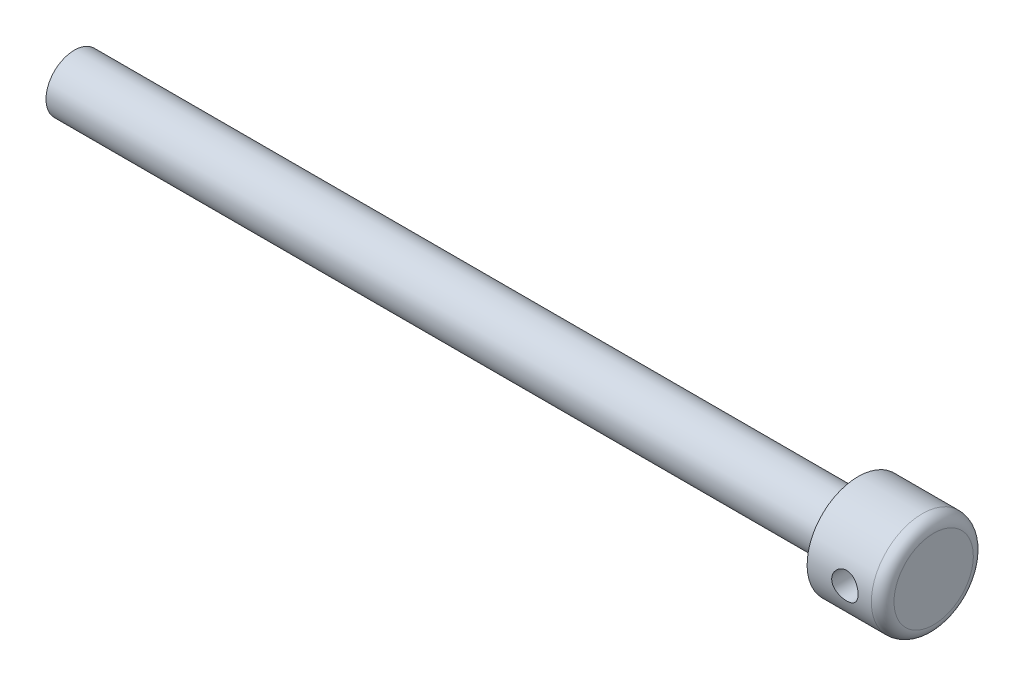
from build123d import *

# Parameters (mm, degrees)
SKETCH1_R               = 15
BOSS_EXTRUDE1_DEPTH     = 415
SKETCH3_R               = 27
BOSS_EXTRUDE2_DEPTH     = 40
CUT_EXTRUDE1_DEPTH      = 287.95165098
CUT_EXTRUDE1_DEPTH_BACK = 287.95165098
SKETCH4_R               = 7
FILLET1_R               = 6


with BuildPart() as part:
    # Sketch1 → Boss-Extrude1 (new body)
    with BuildSketch(Plane(origin=(192.5, 0, 0), x_dir=(0, 0, -1), z_dir=(1, 0, 0))):
        with Locations(Location((0, 139, 0), (0, 0, 90))):
            Circle(SKETCH1_R)
    extrude(amount=-BOSS_EXTRUDE1_DEPTH)

    # Sketch3 → Boss-Extrude2 (add)
    with BuildSketch(Plane(origin=(192.5, 0, 0), x_dir=(0, 0, -1), z_dir=(1, 0, 0))):
        with Locations(Location((0, 139, 0), (0, 0, 90))):
            Circle(SKETCH3_R)
    extrude(amount=BOSS_EXTRUDE2_DEPTH)

    # Sketch4 → Cut-Extrude1 (cut, two sides: drawn at the far end of the back side and taken through both)
    with BuildSketch(Plane.XY.offset(-CUT_EXTRUDE1_DEPTH_BACK)):
        with Locations((212.5, 139)):
            Circle(SKETCH4_R)
    extrude(amount=CUT_EXTRUDE1_DEPTH + CUT_EXTRUDE1_DEPTH_BACK, mode=Mode.SUBTRACT)

    # Fillet1
    fillet1_edges = [part.edges().sort_by_distance(p)[0] for p in [
        (232.5, 112, 0),
    ]]
    fillet(fillet1_edges, radius=FILLET1_R)


solid = part.part
